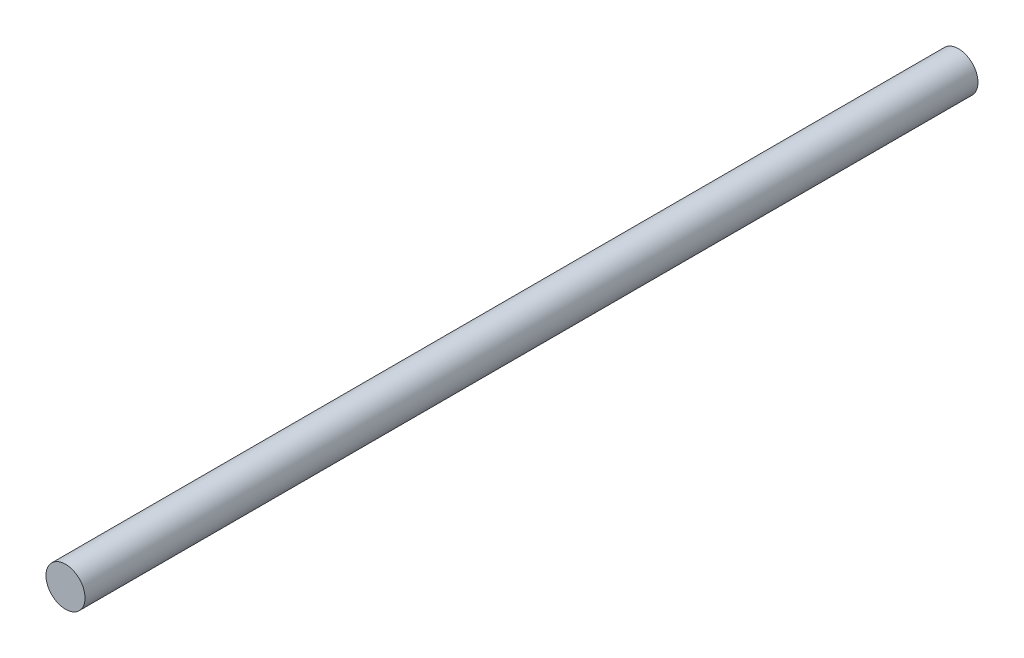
ISO-10303-21;
HEADER;
FILE_DESCRIPTION(('STEP AP214'),'2;1');
FILE_NAME('part.step','',(''),(''),'','','');
FILE_SCHEMA(('AUTOMOTIVE_DESIGN { 1 0 10303 214 1 1 1 1 }'));
ENDSEC;
DATA;
#1=APPLICATION_CONTEXT('core data for automotive mechanical design processes');
#2=APPLICATION_PROTOCOL_DEFINITION('international standard','automotive_design',2000,#1);
#3=PRODUCT_CONTEXT('',#1,'mechanical');
#4=PRODUCT('Part','Part','',(#3));
#5=PRODUCT_RELATED_PRODUCT_CATEGORY('part','',(#4));
#6=PRODUCT_DEFINITION_FORMATION('','',#4);
#7=PRODUCT_DEFINITION_CONTEXT('part definition',#1,'design');
#8=PRODUCT_DEFINITION('design','',#6,#7);
#9=PRODUCT_DEFINITION_SHAPE('','',#8);
#10=(LENGTH_UNIT() NAMED_UNIT(*) SI_UNIT(.MILLI.,.METRE.));
#11=(NAMED_UNIT(*) PLANE_ANGLE_UNIT() SI_UNIT($,.RADIAN.));
#12=(NAMED_UNIT(*) SI_UNIT($,.STERADIAN.) SOLID_ANGLE_UNIT());
#13=UNCERTAINTY_MEASURE_WITH_UNIT(LENGTH_MEASURE(1.E-05),#10,'distance_accuracy_value','');
#14=(GEOMETRIC_REPRESENTATION_CONTEXT(3) GLOBAL_UNCERTAINTY_ASSIGNED_CONTEXT((#13)) GLOBAL_UNIT_ASSIGNED_CONTEXT((#10,
#11,#12)) REPRESENTATION_CONTEXT('',''));
#15=CARTESIAN_POINT('',(0.,0.,0.));
#16=DIRECTION('',(0.,0.,1.));
#17=DIRECTION('',(1.,0.,0.));
#18=AXIS2_PLACEMENT_3D('',#15,#16,#17);
#19=CARTESIAN_POINT('',(0.,0.,228.6));
#20=DIRECTION('',(0.,0.,-1.));
#21=DIRECTION('',(-1.,0.,0.));
#22=AXIS2_PLACEMENT_3D('',#19,#20,#21);
#23=CYLINDRICAL_SURFACE('',#22,5.);
#24=CARTESIAN_POINT('',(0.,0.,228.6));
#25=DIRECTION('',(0.,0.,1.));
#26=DIRECTION('',(1.,0.,0.));
#27=AXIS2_PLACEMENT_3D('',#24,#25,#26);
#28=CIRCLE('',#27,5.);
#29=CARTESIAN_POINT('',(5.,0.,228.6));
#30=VERTEX_POINT('',#29);
#31=EDGE_CURVE('E10',#30,#30,#28,.T.);
#32=ORIENTED_EDGE('',*,*,#31,.F.);
#33=EDGE_LOOP('',(#32));
#34=FACE_BOUND('',#33,.T.);
#35=CARTESIAN_POINT('',(0.,0.,0.));
#36=DIRECTION('',(0.,0.,1.));
#37=DIRECTION('',(1.,0.,0.));
#38=AXIS2_PLACEMENT_3D('',#35,#36,#37);
#39=CIRCLE('',#38,5.);
#40=CARTESIAN_POINT('',(5.,0.,0.));
#41=VERTEX_POINT('',#40);
#42=EDGE_CURVE('E34',#41,#41,#39,.T.);
#43=ORIENTED_EDGE('',*,*,#42,.T.);
#44=EDGE_LOOP('',(#43));
#45=FACE_BOUND('',#44,.T.);
#46=ADVANCED_FACE('F31',(#34,#45),#23,.T.);
#47=CARTESIAN_POINT('',(0.,0.,228.6));
#48=DIRECTION('',(0.,0.,1.));
#49=DIRECTION('',(1.,0.,0.));
#50=AXIS2_PLACEMENT_3D('',#47,#48,#49);
#51=PLANE('',#50);
#52=ORIENTED_EDGE('',*,*,#31,.T.);
#53=EDGE_LOOP('',(#52));
#54=FACE_BOUND('',#53,.T.);
#55=ADVANCED_FACE('F46',(#54),#51,.T.);
#56=CARTESIAN_POINT('',(0.,0.,0.));
#57=DIRECTION('',(0.,0.,1.));
#58=DIRECTION('',(1.,0.,0.));
#59=AXIS2_PLACEMENT_3D('',#56,#57,#58);
#60=PLANE('',#59);
#61=ORIENTED_EDGE('',*,*,#42,.F.);
#62=EDGE_LOOP('',(#61));
#63=FACE_BOUND('',#62,.T.);
#64=ADVANCED_FACE('F44',(#63),#60,.F.);
#65=CLOSED_SHELL('',(#46,#55,#64));
#66=MANIFOLD_SOLID_BREP('B2',#65);
#67=ADVANCED_BREP_SHAPE_REPRESENTATION('',(#18,#66),#14);
#68=SHAPE_DEFINITION_REPRESENTATION(#9,#67);
ENDSEC;
END-ISO-10303-21;
